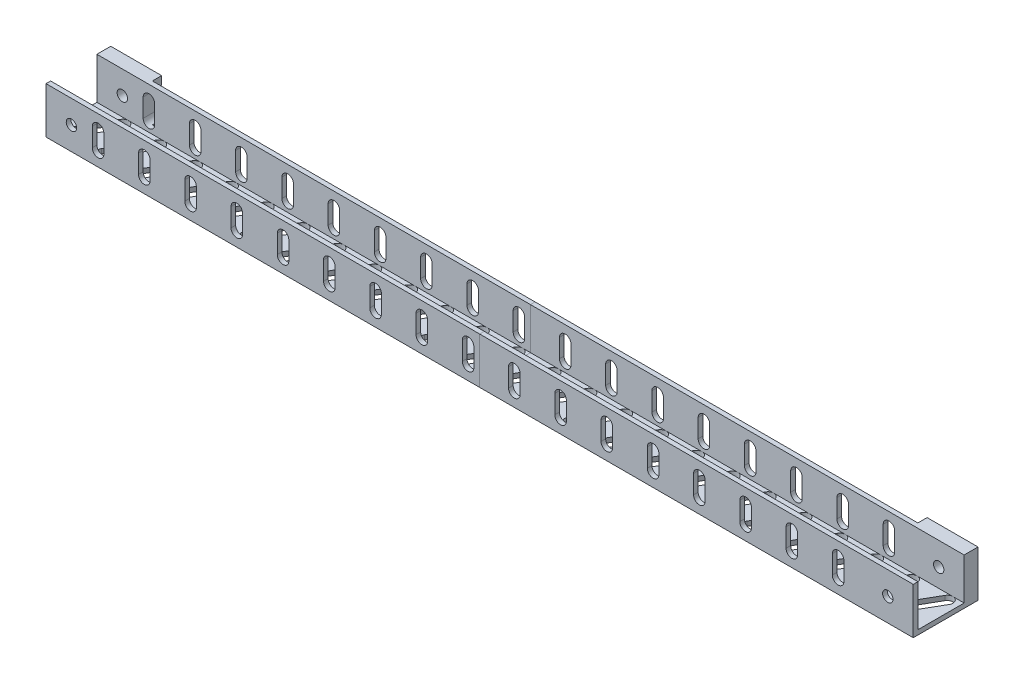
from build123d import *

# Parameters (mm, degrees)
BOSS_EXTRUDE1_DEPTH = 375
SKETCH2_W           = 22
SKETCH2_H           = 20
BOSS_EXTRUDE2_DEPTH = 4
SKETCH3_R           = 2.25
CUT_EXTRUDE1_DEPTH  = 377.575357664
CUT_EXTRUDE2_DEPTH  = 377.474434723
CUT_EXTRUDE3_DEPTH  = 377.575357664


with BuildPart() as part:
    # Sketch1 → Boss-Extrude1 (new body)
    with BuildSketch(Plane(origin=(0, 0, 0), x_dir=(0, 0, -1), z_dir=(1, 0, 0))):
        Polygon((0, 0), (24, 0), (24, 20), (22, 20), (22, 2), (2, 2), (2, 20), (0, 20), align=None)
    extrude(amount=BOSS_EXTRUDE1_DEPTH)

    # Sketch2 → Boss-Extrude2 (add)
    with BuildSketch(Plane(origin=(0, 0, -24), x_dir=(-1, 0, 0), z_dir=(0, 0, -1))):
        with Locations((-11, 10)):
            Rectangle(SKETCH2_W, SKETCH2_H)
        with Locations((-364, 10)):
            Rectangle(SKETCH2_W, SKETCH2_H)
    extrude(amount=BOSS_EXTRUDE2_DEPTH)

    # Sketch3 → Cut-Extrude1 (cut, through all)
    with BuildSketch(Plane(origin=(0, 0, -28), x_dir=(-1, 0, 0), z_dir=(0, 0, -1))):
        with Locations(Location((-11, 10, 0), (0, 0, 90))):
            Circle(SKETCH3_R)
        with Locations((-364, 10)):
            Circle(SKETCH3_R)
    extrude(amount=-CUT_EXTRUDE1_DEPTH, mode=Mode.SUBTRACT)

    # Sketch4 → Cut-Extrude2 (cut, through all)
    with BuildSketch(Plane(origin=(0, 2, 0), x_dir=(1, 0, 0), z_dir=(0, 1, 0))):
        with BuildLine():
            Line((2.834936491, 5.75), (11.495190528, 20.75))
            ThreePointArc((11.495190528, 20.75), (14.910254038, 21.665063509), (15.825317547, 18.25))
            Line((15.825317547, 18.25), (7.165063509, 3.25))
            ThreePointArc((7.165063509, 3.25), (3.75, 2.334936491), (2.834936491, 5.75))
        make_face()
        with BuildLine():
            Line((22.665063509, 3.25), (31.325317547, 18.25))
            ThreePointArc((31.325317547, 18.25), (30.410254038, 21.665063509), (26.995190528, 20.75))
            Line((26.995190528, 20.75), (18.334936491, 5.75))
            ThreePointArc((18.334936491, 5.75), (19.25, 2.334936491), (22.665063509, 3.25))
        make_face()
        with BuildLine():
            Line((38.165063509, 3.25), (46.825317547, 18.25))
            ThreePointArc((46.825317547, 18.25), (45.910254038, 21.665063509), (42.495190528, 20.75))
            Line((42.495190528, 20.75), (33.834936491, 5.75))
            ThreePointArc((33.834936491, 5.75), (34.75, 2.334936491), (38.165063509, 3.25))
        make_face()
        with BuildLine():
            Line((53.665063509, 3.25), (62.325317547, 18.25))
            ThreePointArc((62.325317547, 18.25), (61.410254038, 21.665063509), (57.995190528, 20.75))
            Line((57.995190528, 20.75), (49.334936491, 5.75))
            ThreePointArc((49.334936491, 5.75), (50.25, 2.334936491), (53.665063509, 3.25))
        make_face()
        with BuildLine():
            Line((69.165063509, 3.25), (77.825317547, 18.25))
            ThreePointArc((77.825317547, 18.25), (76.910254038, 21.665063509), (73.495190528, 20.75))
            Line((73.495190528, 20.75), (64.834936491, 5.75))
            ThreePointArc((64.834936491, 5.75), (65.75, 2.334936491), (69.165063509, 3.25))
        make_face()
        with BuildLine():
            Line((84.665063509, 3.25), (93.325317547, 18.25))
            ThreePointArc((93.325317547, 18.25), (92.410254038, 21.665063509), (88.995190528, 20.75))
            Line((88.995190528, 20.75), (80.334936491, 5.75))
            ThreePointArc((80.334936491, 5.75), (81.25, 2.334936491), (84.665063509, 3.25))
        make_face()
        with BuildLine():
            Line((100.165063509, 3.25), (108.825317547, 18.25))
            ThreePointArc((108.825317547, 18.25), (107.910254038, 21.665063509), (104.495190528, 20.75))
            Line((104.495190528, 20.75), (95.834936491, 5.75))
            ThreePointArc((95.834936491, 5.75), (96.75, 2.334936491), (100.165063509, 3.25))
        make_face()
        with BuildLine():
            Line((115.665063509, 3.25), (124.325317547, 18.25))
            ThreePointArc((124.325317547, 18.25), (123.410254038, 21.665063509), (119.995190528, 20.75))
            Line((119.995190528, 20.75), (111.334936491, 5.75))
            ThreePointArc((111.334936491, 5.75), (112.25, 2.334936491), (115.665063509, 3.25))
        make_face()
        with BuildLine():
            Line((131.165063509, 3.25), (139.825317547, 18.25))
            ThreePointArc((139.825317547, 18.25), (138.910254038, 21.665063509), (135.495190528, 20.75))
            Line((135.495190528, 20.75), (126.834936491, 5.75))
            ThreePointArc((126.834936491, 5.75), (127.75, 2.334936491), (131.165063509, 3.25))
        make_face()
        with BuildLine():
            Line((146.665063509, 3.25), (155.325317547, 18.25))
            ThreePointArc((155.325317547, 18.25), (154.410254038, 21.665063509), (150.995190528, 20.75))
            Line((150.995190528, 20.75), (142.334936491, 5.75))
            ThreePointArc((142.334936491, 5.75), (143.25, 2.334936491), (146.665063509, 3.25))
        make_face()
        with BuildLine():
            Line((162.165063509, 3.25), (170.825317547, 18.25))
            ThreePointArc((170.825317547, 18.25), (169.910254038, 21.665063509), (166.495190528, 20.75))
            Line((166.495190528, 20.75), (157.834936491, 5.75))
            ThreePointArc((157.834936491, 5.75), (158.75, 2.334936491), (162.165063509, 3.25))
        make_face()
        with BuildLine():
            Line((177.665063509, 3.25), (186.325317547, 18.25))
            ThreePointArc((186.325317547, 18.25), (185.410254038, 21.665063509), (181.995190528, 20.75))
            Line((181.995190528, 20.75), (173.334936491, 5.75))
            ThreePointArc((173.334936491, 5.75), (174.25, 2.334936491), (177.665063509, 3.25))
        make_face()
        with BuildLine():
            Line((193.165063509, 3.25), (201.825317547, 18.25))
            ThreePointArc((201.825317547, 18.25), (200.910254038, 21.665063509), (197.495190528, 20.75))
            Line((197.495190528, 20.75), (188.834936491, 5.75))
            ThreePointArc((188.834936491, 5.75), (189.75, 2.334936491), (193.165063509, 3.25))
        make_face()
        with BuildLine():
            Line((208.665063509, 3.25), (217.325317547, 18.25))
            ThreePointArc((217.325317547, 18.25), (216.410254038, 21.665063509), (212.995190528, 20.75))
            Line((212.995190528, 20.75), (204.334936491, 5.75))
            ThreePointArc((204.334936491, 5.75), (205.25, 2.334936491), (208.665063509, 3.25))
        make_face()
        with BuildLine():
            Line((224.165063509, 3.25), (232.825317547, 18.25))
            ThreePointArc((232.825317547, 18.25), (231.910254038, 21.665063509), (228.495190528, 20.75))
            Line((228.495190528, 20.75), (219.834936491, 5.75))
            ThreePointArc((219.834936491, 5.75), (220.75, 2.334936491), (224.165063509, 3.25))
        make_face()
        with BuildLine():
            Line((239.665063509, 3.25), (248.325317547, 18.25))
            ThreePointArc((248.325317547, 18.25), (247.410254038, 21.665063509), (243.995190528, 20.75))
            Line((243.995190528, 20.75), (235.334936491, 5.75))
            ThreePointArc((235.334936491, 5.75), (236.25, 2.334936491), (239.665063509, 3.25))
        make_face()
        with BuildLine():
            Line((255.165063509, 3.25), (263.825317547, 18.25))
            ThreePointArc((263.825317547, 18.25), (262.910254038, 21.665063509), (259.495190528, 20.75))
            Line((259.495190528, 20.75), (250.834936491, 5.75))
            ThreePointArc((250.834936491, 5.75), (251.75, 2.334936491), (255.165063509, 3.25))
        make_face()
        with BuildLine():
            Line((270.665063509, 3.25), (279.325317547, 18.25))
            ThreePointArc((279.325317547, 18.25), (278.410254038, 21.665063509), (274.995190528, 20.75))
            Line((274.995190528, 20.75), (266.334936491, 5.75))
            ThreePointArc((266.334936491, 5.75), (267.25, 2.334936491), (270.665063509, 3.25))
        make_face()
        with BuildLine():
            Line((286.165063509, 3.25), (294.825317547, 18.25))
            ThreePointArc((294.825317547, 18.25), (293.910254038, 21.665063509), (290.495190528, 20.75))
            Line((290.495190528, 20.75), (281.834936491, 5.75))
            ThreePointArc((281.834936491, 5.75), (282.75, 2.334936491), (286.165063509, 3.25))
        make_face()
        with BuildLine():
            Line((301.665063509, 3.25), (310.325317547, 18.25))
            ThreePointArc((310.325317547, 18.25), (309.410254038, 21.665063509), (305.995190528, 20.75))
            Line((305.995190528, 20.75), (297.334936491, 5.75))
            ThreePointArc((297.334936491, 5.75), (298.25, 2.334936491), (301.665063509, 3.25))
        make_face()
        with BuildLine():
            Line((317.165063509, 3.25), (325.825317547, 18.25))
            ThreePointArc((325.825317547, 18.25), (324.910254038, 21.665063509), (321.495190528, 20.75))
            Line((321.495190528, 20.75), (312.834936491, 5.75))
            ThreePointArc((312.834936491, 5.75), (313.75, 2.334936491), (317.165063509, 3.25))
        make_face()
        with BuildLine():
            Line((332.665063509, 3.25), (341.325317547, 18.25))
            ThreePointArc((341.325317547, 18.25), (340.410254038, 21.665063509), (336.995190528, 20.75))
            Line((336.995190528, 20.75), (328.334936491, 5.75))
            ThreePointArc((328.334936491, 5.75), (329.25, 2.334936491), (332.665063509, 3.25))
        make_face()
        with BuildLine():
            Line((348.165063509, 3.25), (356.825317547, 18.25))
            ThreePointArc((356.825317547, 18.25), (355.910254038, 21.665063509), (352.495190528, 20.75))
            Line((352.495190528, 20.75), (343.834936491, 5.75))
            ThreePointArc((343.834936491, 5.75), (344.75, 2.334936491), (348.165063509, 3.25))
        make_face()
        with BuildLine():
            Line((363.665063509, 3.25), (372.325317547, 18.25))
            ThreePointArc((372.325317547, 18.25), (371.410254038, 21.665063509), (367.995190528, 20.75))
            Line((367.995190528, 20.75), (359.334936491, 5.75))
            ThreePointArc((359.334936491, 5.75), (360.25, 2.334936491), (363.665063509, 3.25))
        make_face()
    extrude(amount=-CUT_EXTRUDE2_DEPTH, mode=Mode.SUBTRACT)

    # Sketch5 → Cut-Extrude3 (cut, through all)
    with BuildSketch(Plane.XY):
        with BuildLine():
            Line((25, 14), (25, 6))
            ThreePointArc((25, 6), (22.5, 3.5), (20, 6))
            Line((20, 6), (20, 14))
            ThreePointArc((20, 14), (22.5, 16.5), (25, 14))
        make_face()
        with BuildLine():
            Line((40, 14), (40, 6))
            ThreePointArc((40, 6), (42.5, 3.5), (45, 6))
            Line((45, 6), (45, 14))
            ThreePointArc((45, 14), (42.5, 16.5), (40, 14))
        make_face()
        with BuildLine():
            Line((60, 14), (60, 6))
            ThreePointArc((60, 6), (62.5, 3.5), (65, 6))
            Line((65, 6), (65, 14))
            ThreePointArc((65, 14), (62.5, 16.5), (60, 14))
        make_face()
        with BuildLine():
            Line((80, 14), (80, 6))
            ThreePointArc((80, 6), (82.5, 3.5), (85, 6))
            Line((85, 6), (85, 14))
            ThreePointArc((85, 14), (82.5, 16.5), (80, 14))
        make_face()
        with BuildLine():
            Line((100, 14), (100, 6))
            ThreePointArc((100, 6), (102.5, 3.5), (105, 6))
            Line((105, 6), (105, 14))
            ThreePointArc((105, 14), (102.5, 16.5), (100, 14))
        make_face()
        with BuildLine():
            Line((120, 14), (120, 6))
            ThreePointArc((120, 6), (122.5, 3.5), (125, 6))
            Line((125, 6), (125, 14))
            ThreePointArc((125, 14), (122.5, 16.5), (120, 14))
        make_face()
        with BuildLine():
            Line((140, 14), (140, 6))
            ThreePointArc((140, 6), (142.5, 3.5), (145, 6))
            Line((145, 6), (145, 14))
            ThreePointArc((145, 14), (142.5, 16.5), (140, 14))
        make_face()
        with BuildLine():
            Line((160, 14), (160, 6))
            ThreePointArc((160, 6), (162.5, 3.5), (165, 6))
            Line((165, 6), (165, 14))
            ThreePointArc((165, 14), (162.5, 16.5), (160, 14))
        make_face()
        with BuildLine():
            Line((180, 14), (180, 6))
            ThreePointArc((180, 6), (182.5, 3.5), (185, 6))
            Line((185, 6), (185, 14))
            ThreePointArc((185, 14), (182.5, 16.5), (180, 14))
        make_face()
        with BuildLine():
            Line((200, 14), (200, 6))
            ThreePointArc((200, 6), (202.5, 3.5), (205, 6))
            Line((205, 6), (205, 14))
            ThreePointArc((205, 14), (202.5, 16.5), (200, 14))
        make_face()
        with BuildLine():
            Line((220, 14), (220, 6))
            ThreePointArc((220, 6), (222.5, 3.5), (225, 6))
            Line((225, 6), (225, 14))
            ThreePointArc((225, 14), (222.5, 16.5), (220, 14))
        make_face()
        with BuildLine():
            Line((240, 14), (240, 6))
            ThreePointArc((240, 6), (242.5, 3.5), (245, 6))
            Line((245, 6), (245, 14))
            ThreePointArc((245, 14), (242.5, 16.5), (240, 14))
        make_face()
        with BuildLine():
            Line((260, 14), (260, 6))
            ThreePointArc((260, 6), (262.5, 3.5), (265, 6))
            Line((265, 6), (265, 14))
            ThreePointArc((265, 14), (262.5, 16.5), (260, 14))
        make_face()
        with BuildLine():
            Line((280, 14), (280, 6))
            ThreePointArc((280, 6), (282.5, 3.5), (285, 6))
            Line((285, 6), (285, 14))
            ThreePointArc((285, 14), (282.5, 16.5), (280, 14))
        make_face()
        with BuildLine():
            Line((300, 14), (300, 6))
            ThreePointArc((300, 6), (302.5, 3.5), (305, 6))
            Line((305, 6), (305, 14))
            ThreePointArc((305, 14), (302.5, 16.5), (300, 14))
        make_face()
        with BuildLine():
            Line((320, 14), (320, 6))
            ThreePointArc((320, 6), (322.5, 3.5), (325, 6))
            Line((325, 6), (325, 14))
            ThreePointArc((325, 14), (322.5, 16.5), (320, 14))
        make_face()
        with BuildLine():
            Line((340, 14), (340, 6))
            ThreePointArc((340, 6), (342.5, 3.5), (345, 6))
            Line((345, 6), (345, 14))
            ThreePointArc((345, 14), (342.5, 16.5), (340, 14))
        make_face()
    extrude(amount=-CUT_EXTRUDE3_DEPTH, mode=Mode.SUBTRACT)


with BuildPart() as body_2:
    # Split1: the piece on the far side of the plane
    add(part.part)
    split(bisect_by=Plane(origin=(187.5, 0, 0), x_dir=(0, 0, -1), z_dir=(-1, 0, 0)), keep=Keep.BOTTOM)


with BuildPart() as part_1:
    add(part.part)

    # Split1
    split(bisect_by=Plane(origin=(187.5, 0, 0), x_dir=(0, 0, -1), z_dir=(-1, 0, 0)), keep=Keep.TOP)


solid = Compound([body_2.part, part_1.part])
